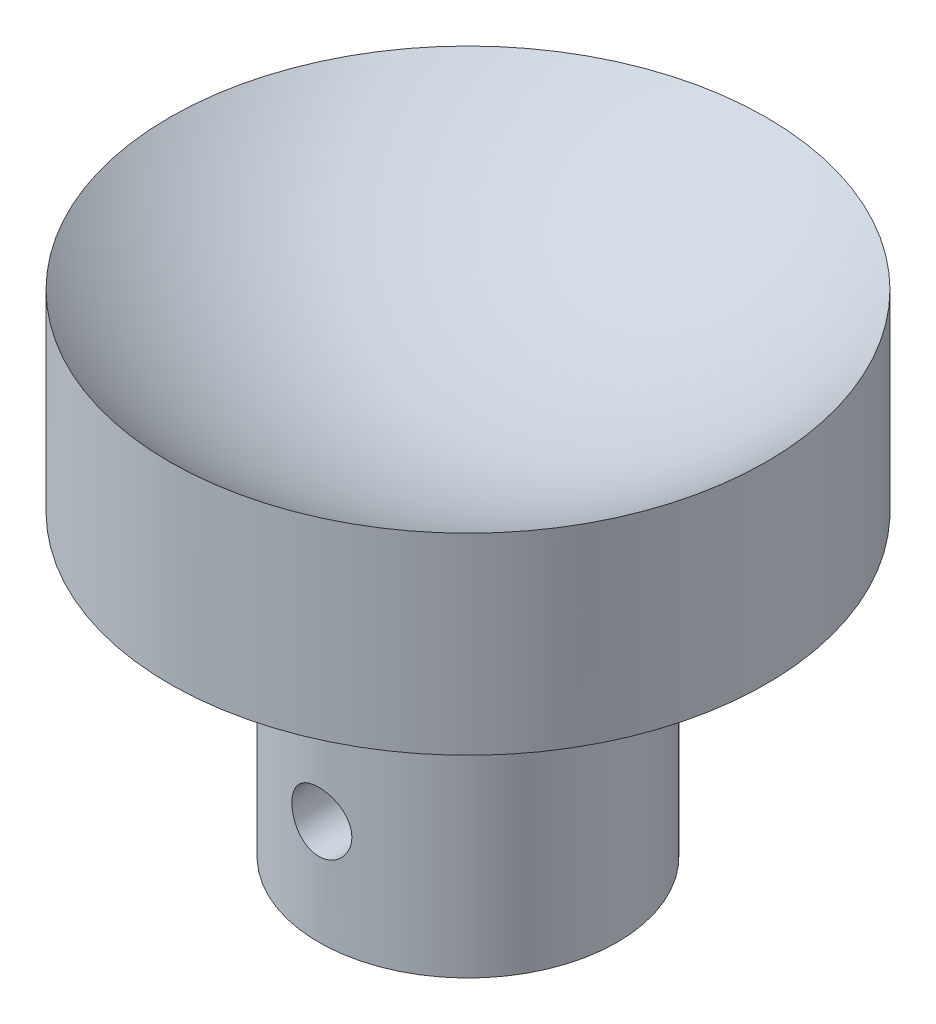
from build123d import *

# Parameters (mm, degrees)
SKETCH3_R               = 7.14375
CUT_EXTRUDE2_DEPTH      = 15.24
F_1_4_20_TAPPED_HOLE1_D = 5.1054


with BuildPart() as part:
    # Sketch1 → Revolve1 (revolve)
    with BuildSketch(Plane.XY, mode=Mode.PRIVATE) as revolve1_sk:
        with BuildLine():
            Line((0, 0), (0, -25.4))
            Line((0, -25.4), (12.7, -25.4))
            Line((12.7, -25.4), (12.7, 0))
            Line((12.7, 0), (25.4, 0))
            Line((25.4, 0), (25.4, 16.370832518))
            ThreePointArc((25.4, 16.370832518), (13.652628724, 8.945769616), (0, 6.35))
            Line((0, 6.35), (0, 0))
        make_face()
    revolve(revolve1_sk.sketch.rotate(Axis((0, 0, 0), (0, -1, 0)), 180), axis=Axis((0, 0, 0), (0, -1, 0)))

    # Sketch3 → Cut-Extrude2 (cut)
    with BuildSketch(Plane.XZ.offset(25.4)):
        Circle(SKETCH3_R)
    extrude(amount=-CUT_EXTRUDE2_DEPTH, mode=Mode.SUBTRACT)

    # 1_4-20 Tapped Hole1 (through all)
    with Locations(Plane(origin=(0, -16.51, 12.7), x_dir=(1, 0, 0), z_dir=(0, 0, 1))):
        with Locations((0, 0)):
            Hole(F_1_4_20_TAPPED_HOLE1_D / 2)


solid = part.part
